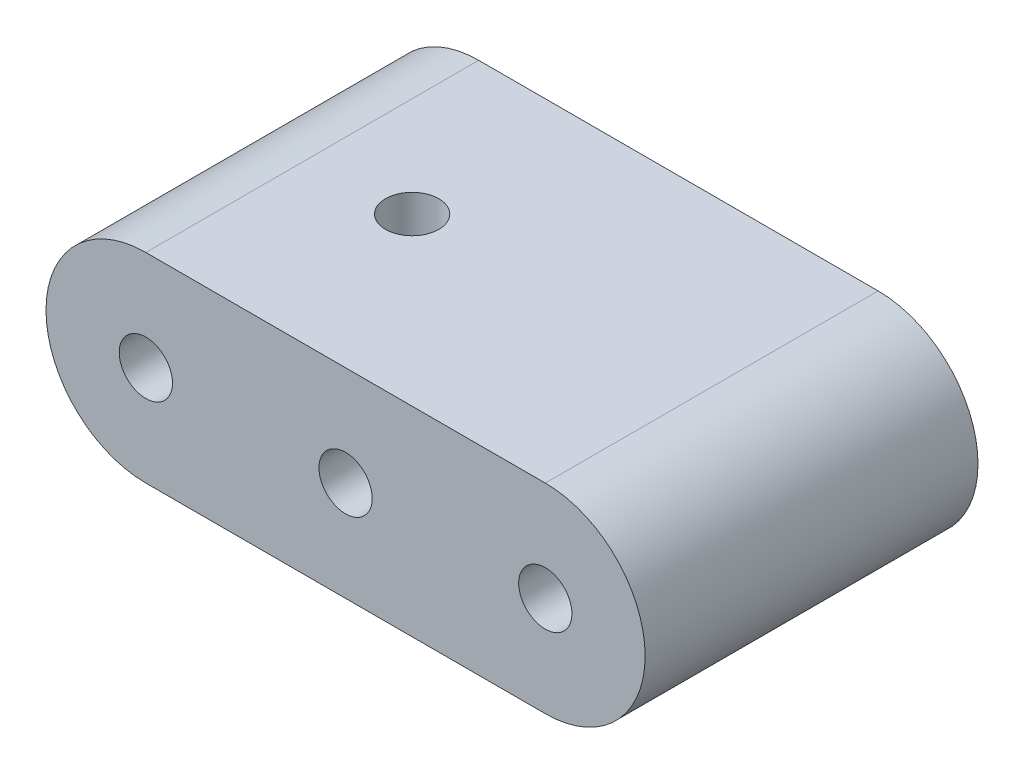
from build123d import *

# Parameters (mm, degrees)
Y_KSEKLIK_EKSTR_ZYON1_DEPTH = 50
IZIM2_R                     = 4
KES_EKSTR_ZYON1_DEPTH       = 6
KES_EKSTR_ZYON2_START       = -6
IZIM3_R                     = 4
KES_EKSTR_ZYON2_DEPTH       = 6
IZIM4_R                     = 4
KES_EKSTR_ZYON3_DEPTH       = 6
KES_EKSTR_ZYON4_DEPTH       = 30


with BuildPart() as part:
    # izim1 → Y_kseklik-Ekstr_zyon1 (new body)
    with BuildSketch(Plane.XY):
        with BuildLine():
            Line((-30, 15), (30, 15))
            ThreePointArc((30, 15), (45, 0), (30, -15))
            Line((30, -15), (-30, -15))
            ThreePointArc((-30, -15), (-45, 0), (-30, 15))
        make_face()
    extrude(amount=Y_KSEKLIK_EKSTR_ZYON1_DEPTH)

    # izim2 → Kes-Ekstr_zyon1 (cut)
    with BuildSketch(Plane.XY.offset(50)):
        with Locations((-30, 0)):
            Circle(IZIM2_R)
        Circle(IZIM2_R)
        with Locations((30, 0)):
            Circle(IZIM2_R)
    extrude(amount=-KES_EKSTR_ZYON1_DEPTH, mode=Mode.SUBTRACT)

    # izim3 → Kes-Ekstr_zyon2 (cut)
    with BuildSketch(Plane(origin=(0, 0, 0), x_dir=(-1, 0, 0), z_dir=(0, 0, -1)).offset(KES_EKSTR_ZYON2_START)):
        with Locations(Location((-30, 0, 0), (0, 0, 180))):
            Circle(IZIM3_R)
        with Locations(Location((0, 0, 0), (0, 0, 180))):
            Circle(IZIM3_R)
        with Locations(Location((30, 0, 0), (0, 0, 180))):
            Circle(IZIM3_R)
    extrude(amount=KES_EKSTR_ZYON2_DEPTH, mode=Mode.SUBTRACT)

    # izim4 → Kes-Ekstr_zyon3 (cut)
    with BuildSketch(Plane(origin=(0, 15, 0), x_dir=(1, 0, 0), z_dir=(0, 1, 0))):
        with Locations(Location((-15, -25, 0), (0, 0, 180))):
            Circle(IZIM4_R)
    extrude(amount=-KES_EKSTR_ZYON3_DEPTH, mode=Mode.SUBTRACT)

    # izim5 → Kes-Ekstr_zyon4 (cut)
    with BuildSketch(Plane(origin=(0, 0, 10), x_dir=(-1, 0, 0), z_dir=(0, 0, -1))):
        with BuildLine():
            Line((-21.339745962, 5), (21.339745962, 5))
            ThreePointArc((21.339745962, 5), (40, 0), (21.339745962, -5))
            Line((21.339745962, -5), (-21.339745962, -5))
            ThreePointArc((-21.339745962, -5), (-40, 0), (-21.339745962, 5))
        make_face()
    extrude(amount=-KES_EKSTR_ZYON4_DEPTH, mode=Mode.SUBTRACT)


solid = part.part
